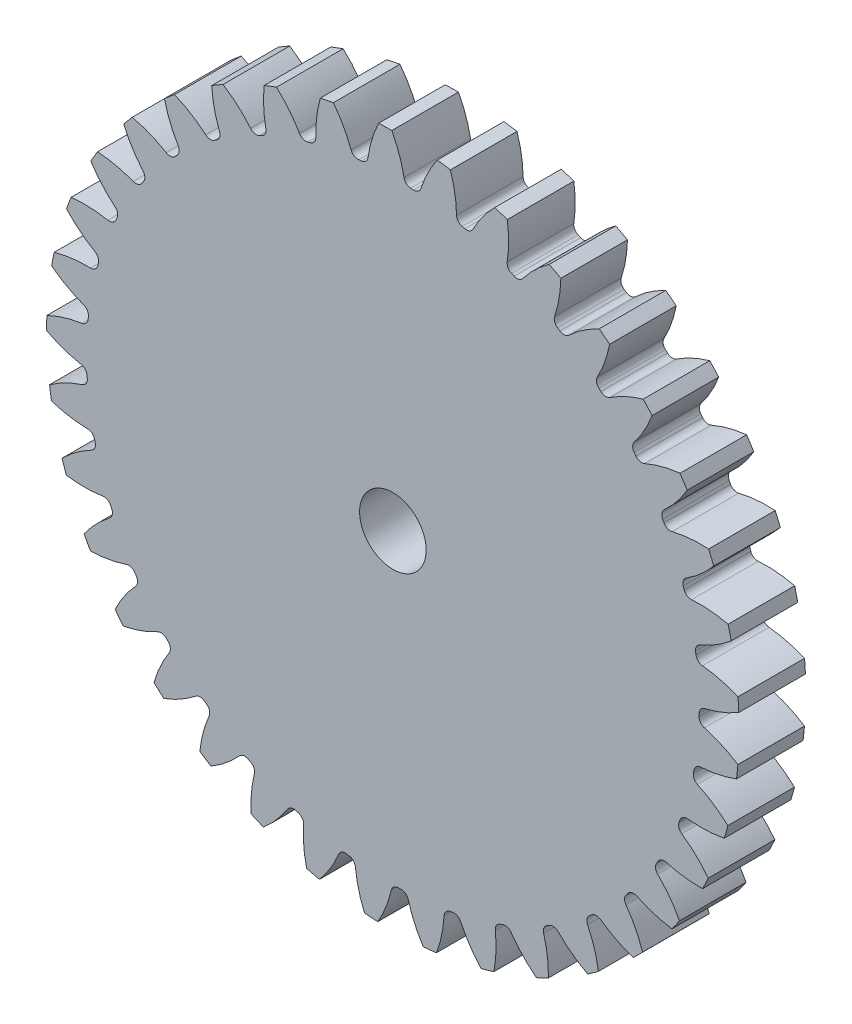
from build123d import *

# Parameters (mm, degrees)
SKETCH3_R         = 660.4
GEARBODY_DEPTH    = 127
TOOTHCUT_DEPTH    = 943.541946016
CIRPATTERN1_COUNT = 37
BOREDIA_R         = 63.5
BORE_DEPTH        = 12700


with BuildPart() as part:
    # Sketch3 → gearBody (new body)
    with BuildSketch(Plane.XY):
        Circle(SKETCH3_R)
    extrude(amount=GEARBODY_DEPTH)

    # Sketch2 → toothCut (cut, through all)
    with BuildSketch(Plane.XY):
        with BuildLine():
            ThreePointArc((584.018001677, -14.581279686), (584.079170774, -11.881172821), (584.127856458, -9.180812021))
            ThreePointArc((584.127856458, -9.180812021), (587.19403407, -0.727836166), (594.820537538, 4.035638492))
            ThreePointArc((594.820537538, 4.035638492), (628.642815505, 14.653865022), (660.4, 30.407418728))
            ThreePointArc((660.4, 30.407418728), (660.962933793, -13.44512052), (658.617131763, -57.23849109))
            ThreePointArc((658.617131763, -57.23849109), (627.52686127, -40.206512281), (594.164369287, -28.221632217))
            ThreePointArc((594.164369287, -28.221632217), (586.737889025, -23.151954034), (584.018001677, -14.581279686))
        make_face()
    toothcut = extrude(amount=TOOTHCUT_DEPTH, mode=Mode.SUBTRACT)

    # CirPattern1: toothCut ×37 about axis
    cirpattern1_axis = Axis((0, 0, 0), (0, 0, 1))
    for i in range(1, CIRPATTERN1_COUNT):
        add(toothcut.rotate(cirpattern1_axis, i * 360 / CIRPATTERN1_COUNT), mode=Mode.SUBTRACT)

    # boreDia → bore (cut, symmetric)
    with BuildSketch(Plane.XY):
        Circle(BOREDIA_R)
    extrude(amount=BORE_DEPTH, both=True, mode=Mode.SUBTRACT)


solid = part.part
